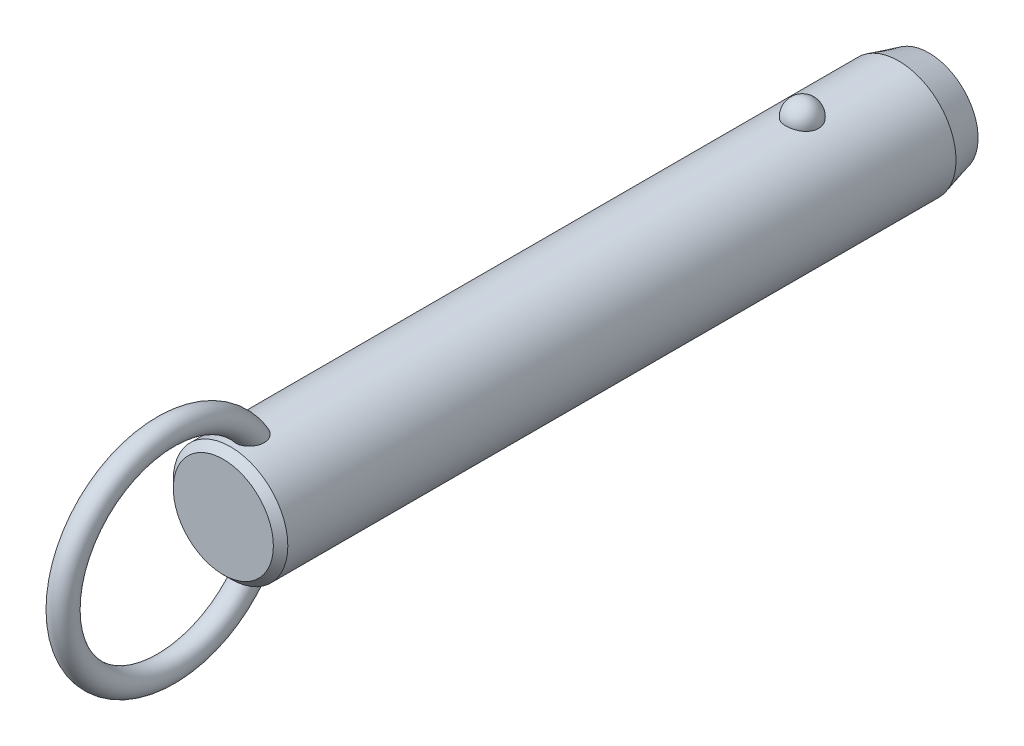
ISO-10303-21;
HEADER;
FILE_DESCRIPTION(('STEP AP214'),'2;1');
FILE_NAME('part.step','',(''),(''),'','','');
FILE_SCHEMA(('AUTOMOTIVE_DESIGN { 1 0 10303 214 1 1 1 1 }'));
ENDSEC;
DATA;
#1=APPLICATION_CONTEXT('core data for automotive mechanical design processes');
#2=APPLICATION_PROTOCOL_DEFINITION('international standard','automotive_design',2000,#1);
#3=PRODUCT_CONTEXT('',#1,'mechanical');
#4=PRODUCT('Part','Part','',(#3));
#5=PRODUCT_RELATED_PRODUCT_CATEGORY('part','',(#4));
#6=PRODUCT_DEFINITION_FORMATION('','',#4);
#7=PRODUCT_DEFINITION_CONTEXT('part definition',#1,'design');
#8=PRODUCT_DEFINITION('design','',#6,#7);
#9=PRODUCT_DEFINITION_SHAPE('','',#8);
#10=(LENGTH_UNIT() NAMED_UNIT(*) SI_UNIT(.MILLI.,.METRE.));
#11=(NAMED_UNIT(*) PLANE_ANGLE_UNIT() SI_UNIT($,.RADIAN.));
#12=(NAMED_UNIT(*) SI_UNIT($,.STERADIAN.) SOLID_ANGLE_UNIT());
#13=UNCERTAINTY_MEASURE_WITH_UNIT(LENGTH_MEASURE(1.E-05),#10,'distance_accuracy_value','');
#14=(GEOMETRIC_REPRESENTATION_CONTEXT(3) GLOBAL_UNCERTAINTY_ASSIGNED_CONTEXT((#13)) GLOBAL_UNIT_ASSIGNED_CONTEXT((#10,
#11,#12)) REPRESENTATION_CONTEXT('',''));
#15=CARTESIAN_POINT('',(0.,0.,0.));
#16=DIRECTION('',(0.,0.,1.));
#17=DIRECTION('',(1.,0.,0.));
#18=AXIS2_PLACEMENT_3D('',#15,#16,#17);
#19=CARTESIAN_POINT('',(0.,0.,83.8));
#20=DIRECTION('',(0.,0.,-1.));
#21=DIRECTION('',(-1.,0.,0.));
#22=AXIS2_PLACEMENT_3D('',#19,#20,#21);
#23=CYLINDRICAL_SURFACE('',#22,9.5);
#24=CARTESIAN_POINT('',(2.67259918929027,9.11631578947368,-2.70000000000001));
#25=CARTESIAN_POINT('',(2.6725968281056,9.11631786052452,-2.54909854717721));
#26=CARTESIAN_POINT('',(2.66030567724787,9.11994722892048,-2.39816735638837));
#27=CARTESIAN_POINT('',(2.6114347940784,9.13405924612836,-2.10058568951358));
#28=CARTESIAN_POINT('',(2.57484658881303,9.14454428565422,-1.95393672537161));
#29=CARTESIAN_POINT('',(2.47830875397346,9.17117631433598,-1.66916069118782));
#30=CARTESIAN_POINT('',(2.41836936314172,9.18732082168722,-1.53102991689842));
#31=CARTESIAN_POINT('',(2.27661331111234,9.22346780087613,-1.26705393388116));
#32=CARTESIAN_POINT('',(2.19479699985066,9.24347021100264,-1.14120852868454));
#33=CARTESIAN_POINT('',(2.01085282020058,9.28522401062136,-0.904632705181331));
#34=CARTESIAN_POINT('',(1.90862396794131,9.30698376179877,-0.793982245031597));
#35=CARTESIAN_POINT('',(1.6867437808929,9.34973971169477,-0.591607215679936));
#36=CARTESIAN_POINT('',(1.56709244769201,9.37073591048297,-0.499882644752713));
#37=CARTESIAN_POINT('',(1.31393976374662,9.40956370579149,-0.338167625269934));
#38=CARTESIAN_POINT('',(1.18048026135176,9.42740444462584,-0.268113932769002));
#39=CARTESIAN_POINT('',(0.903154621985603,9.45799906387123,-0.151390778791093));
#40=CARTESIAN_POINT('',(0.759289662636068,9.47075351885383,-0.104718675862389));
#41=CARTESIAN_POINT('',(0.468074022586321,9.48956256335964,-0.0367633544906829));
#42=CARTESIAN_POINT('',(0.320836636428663,9.49573643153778,-0.0150275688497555));
#43=CARTESIAN_POINT('',(0.0246714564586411,9.50112183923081,0.00396199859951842));
#44=CARTESIAN_POINT('',(-0.124256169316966,9.50033406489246,0.00121819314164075));
#45=CARTESIAN_POINT('',(-0.417264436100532,9.4919475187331,-0.0284441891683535));
#46=CARTESIAN_POINT('',(-0.56138413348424,9.48444885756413,-0.0550074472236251));
#47=CARTESIAN_POINT('',(-0.842986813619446,9.46357853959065,-0.131064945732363));
#48=CARTESIAN_POINT('',(-0.980469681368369,9.450206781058,-0.180559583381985));
#49=CARTESIAN_POINT('',(-1.24585005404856,9.41890822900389,-0.301476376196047));
#50=CARTESIAN_POINT('',(-1.37368611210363,9.40095498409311,-0.373026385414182));
#51=CARTESIAN_POINT('',(-1.61552738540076,9.36242964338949,-0.536025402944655));
#52=CARTESIAN_POINT('',(-1.72953116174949,9.34185727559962,-0.627476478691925));
#53=CARTESIAN_POINT('',(-1.9429225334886,9.29984568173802,-0.829844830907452));
#54=CARTESIAN_POINT('',(-2.04198021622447,9.27839736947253,-0.94110821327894));
#55=CARTESIAN_POINT('',(-2.22026460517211,9.23735994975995,-1.17883414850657));
#56=CARTESIAN_POINT('',(-2.29948985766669,9.21777097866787,-1.30529781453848));
#57=CARTESIAN_POINT('',(-2.43697287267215,9.18238994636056,-1.57158566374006));
#58=CARTESIAN_POINT('',(-2.49497068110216,9.16664569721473,-1.71155057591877));
#59=CARTESIAN_POINT('',(-2.5872073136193,9.14104303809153,-1.99961197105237));
#60=CARTESIAN_POINT('',(-2.62144683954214,9.13118445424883,-2.14770821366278));
#61=CARTESIAN_POINT('',(-2.66521466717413,9.11850622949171,-2.44715424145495));
#62=CARTESIAN_POINT('',(-2.67484831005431,9.11565658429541,-2.59848735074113));
#63=CARTESIAN_POINT('',(-2.66946735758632,9.11723375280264,-2.90067317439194));
#64=CARTESIAN_POINT('',(-2.65445345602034,9.12166036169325,-3.05152590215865));
#65=CARTESIAN_POINT('',(-2.60029711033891,9.13724422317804,-3.34766110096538));
#66=CARTESIAN_POINT('',(-2.56127978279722,9.14836656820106,-3.49296833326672));
#67=CARTESIAN_POINT('',(-2.46018844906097,9.17606676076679,-3.77477535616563));
#68=CARTESIAN_POINT('',(-2.39811349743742,9.1926448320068,-3.9112747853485));
#69=CARTESIAN_POINT('',(-2.25202303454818,9.22952198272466,-4.17244273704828));
#70=CARTESIAN_POINT('',(-2.16788714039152,9.24984129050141,-4.29704106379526));
#71=CARTESIAN_POINT('',(-1.9799408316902,9.29188255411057,-4.53013066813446));
#72=CARTESIAN_POINT('',(-1.87612963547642,9.31360456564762,-4.63862130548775));
#73=CARTESIAN_POINT('',(-1.65105429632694,9.35612959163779,-4.8369029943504));
#74=CARTESIAN_POINT('',(-1.52972405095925,9.37692871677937,-4.92661991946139));
#75=CARTESIAN_POINT('',(-1.27318250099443,9.41518970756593,-5.08429106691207));
#76=CARTESIAN_POINT('',(-1.13797219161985,9.432651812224,-5.15224684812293));
#77=CARTESIAN_POINT('',(-0.859280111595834,9.46208255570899,-5.26371827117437));
#78=CARTESIAN_POINT('',(-0.715925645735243,9.47411833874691,-5.30753421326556));
#79=CARTESIAN_POINT('',(-0.423550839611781,9.4916822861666,-5.37076321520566));
#80=CARTESIAN_POINT('',(-0.2745312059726,9.49721125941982,-5.39017930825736));
#81=CARTESIAN_POINT('',(0.0218446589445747,9.50110860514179,-5.40390587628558));
#82=CARTESIAN_POINT('',(0.16917707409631,9.49961381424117,-5.39869609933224));
#83=CARTESIAN_POINT('',(0.460808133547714,9.48993906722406,-5.36441955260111));
#84=CARTESIAN_POINT('',(0.605106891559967,9.48175936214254,-5.33535367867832));
#85=CARTESIAN_POINT('',(0.886027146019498,9.4596376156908,-5.25435587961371));
#86=CARTESIAN_POINT('',(1.02267710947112,9.44571881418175,-5.20251612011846));
#87=CARTESIAN_POINT('',(1.28523827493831,9.41358993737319,-5.07741549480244));
#88=CARTESIAN_POINT('',(1.41114877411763,9.39537958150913,-5.00415322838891));
#89=CARTESIAN_POINT('',(1.65085227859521,9.3562644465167,-4.83684599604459));
#90=CARTESIAN_POINT('',(1.76442346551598,9.33532178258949,-4.74249218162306));
#91=CARTESIAN_POINT('',(1.97425672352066,9.29321198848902,-4.53620389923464));
#92=CARTESIAN_POINT('',(2.07051582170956,9.27204482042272,-4.42426641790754));
#93=CARTESIAN_POINT('',(2.24490086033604,9.23139221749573,-4.18363183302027));
#94=CARTESIAN_POINT('',(2.32267019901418,9.21194380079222,-4.05466990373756));
#95=CARTESIAN_POINT('',(2.45584092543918,9.1773419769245,-3.78517836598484));
#96=CARTESIAN_POINT('',(2.5112497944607,9.16218713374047,-3.64465264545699));
#97=CARTESIAN_POINT('',(2.59380876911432,9.13913522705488,-3.37104301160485));
#98=CARTESIAN_POINT('',(2.62330266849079,9.13064624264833,-3.23871053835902));
#99=CARTESIAN_POINT('',(2.66269870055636,9.11923566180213,-2.97092664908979));
#100=CARTESIAN_POINT('',(2.67260130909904,9.11631393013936,-2.83547530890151));
#101=CARTESIAN_POINT('',(2.67259918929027,9.11631578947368,-2.70000000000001));
#102=B_SPLINE_CURVE_WITH_KNOTS('',3,(#24,#25,#26,#27,#28,#29,#30,#31,#32,#33,#34,#35,#36,#37,
#38,#39,#40,#41,#42,#43,#44,#45,#46,#47,#48,#49,#50,#51,#52,#53,#54,#55,#56,#57,#58,#59,#60,#61,
#62,#63,#64,#65,#66,#67,#68,#69,#70,#71,#72,#73,#74,#75,#76,#77,#78,#79,#80,#81,#82,#83,#84,#85,
#86,#87,#88,#89,#90,#91,#92,#93,#94,#95,#96,#97,#98,#99,#100,#101),.UNSPECIFIED.,.T.,.F.,(4,2,2,
2,2,2,2,2,2,2,2,2,2,2,2,2,2,2,2,2,2,2,2,2,2,2,2,2,2,2,2,2,2,2,2,2,2,2,4),(0.,0.452217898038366,
0.904593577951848,1.35677112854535,1.80894144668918,2.26340676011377,2.71787203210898,
3.17099820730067,3.62407318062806,4.0687883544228,4.51345969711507,4.95160616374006,
5.38976021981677,5.83050358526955,6.27129275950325,6.72071308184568,7.17016633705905,
7.62495278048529,8.07972578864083,8.53254856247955,8.98535859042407,9.43582813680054,
9.88631615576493,10.3393155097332,10.7923328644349,11.2471065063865,11.7018475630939,
12.150795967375,12.599688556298,13.0398725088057,13.4800399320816,13.9184421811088,
14.3568730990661,14.802202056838,15.2476074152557,15.7010097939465,16.1542603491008,
16.5602594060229,16.966248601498),.UNSPECIFIED.);
#103=CARTESIAN_POINT('',(2.67259918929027,9.11631578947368,-2.70000000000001));
#104=VERTEX_POINT('',#103);
#105=EDGE_CURVE('E41',#104,#104,#102,.T.);
#106=ORIENTED_EDGE('',*,*,#105,.T.);
#107=EDGE_LOOP('',(#106));
#108=FACE_BOUND('',#107,.T.);
#109=CARTESIAN_POINT('',(0.,0.,92.12));
#110=DIRECTION('',(0.,0.,1.));
#111=DIRECTION('',(1.,0.,0.));
#112=AXIS2_PLACEMENT_3D('',#109,#110,#111);
#113=CIRCLE('',#112,9.5);
#114=CARTESIAN_POINT('',(9.5,0.,92.12));
#115=VERTEX_POINT('',#114);
#116=EDGE_CURVE('E10',#115,#115,#113,.F.);
#117=ORIENTED_EDGE('',*,*,#116,.T.);
#118=EDGE_LOOP('',(#117));
#119=FACE_BOUND('',#118,.T.);
#120=CARTESIAN_POINT('',(-0.697062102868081,-9.47439269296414,86.4678088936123));
#121=CARTESIAN_POINT('',(-0.799579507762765,-9.46685146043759,86.5074823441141));
#122=CARTESIAN_POINT('',(-0.898575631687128,-9.45788043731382,86.5559309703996));
#123=CARTESIAN_POINT('',(-1.08670047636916,-9.43811593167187,86.6688685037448));
#124=CARTESIAN_POINT('',(-1.17583204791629,-9.42732297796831,86.7333527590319));
#125=CARTESIAN_POINT('',(-1.34179806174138,-9.40513672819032,86.8762099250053));
#126=CARTESIAN_POINT('',(-1.41865133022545,-9.39374438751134,86.954561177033));
#127=CARTESIAN_POINT('',(-1.5586004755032,-9.37154196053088,87.1227524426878));
#128=CARTESIAN_POINT('',(-1.62169476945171,-9.3607319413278,87.2125937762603));
#129=CARTESIAN_POINT('',(-1.73527695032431,-9.34035749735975,87.4045001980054));
#130=CARTESIAN_POINT('',(-1.7852226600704,-9.33085270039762,87.5068910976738));
#131=CARTESIAN_POINT('',(-1.86924997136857,-9.3143834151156,87.718148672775));
#132=CARTESIAN_POINT('',(-1.90332570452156,-9.30741986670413,87.8270177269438));
#133=CARTESIAN_POINT('',(-1.95893603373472,-9.29588482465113,88.0604730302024));
#134=CARTESIAN_POINT('',(-1.97872420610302,-9.29165182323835,88.1854890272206));
#135=CARTESIAN_POINT('',(-2.00062129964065,-9.28695978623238,88.4370805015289));
#136=CARTESIAN_POINT('',(-2.00272284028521,-9.28650232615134,88.563656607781));
#137=CARTESIAN_POINT('',(-1.98958876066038,-9.28932750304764,88.8368157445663));
#138=CARTESIAN_POINT('',(-1.97143366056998,-9.2932400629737,88.9832519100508));
#139=CARTESIAN_POINT('',(-1.91479925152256,-9.30507151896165,89.2720629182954));
#140=CARTESIAN_POINT('',(-1.87629122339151,-9.31299607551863,89.414431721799));
#141=CARTESIAN_POINT('',(-1.77225683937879,-9.33340232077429,89.7151725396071));
#142=CARTESIAN_POINT('',(-1.70334898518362,-9.34641636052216,89.8723691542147));
#143=CARTESIAN_POINT('',(-1.58111062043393,-9.36759153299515,90.0975171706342));
#144=CARTESIAN_POINT('',(-1.53721459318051,-9.37492619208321,90.1707968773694));
#145=CARTESIAN_POINT('',(-1.44302631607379,-9.38988566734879,90.3130740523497));
#146=CARTESIAN_POINT('',(-1.39273721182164,-9.39751033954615,90.3820736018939));
#147=CARTESIAN_POINT('',(-1.26775962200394,-9.41530678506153,90.5369832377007));
#148=CARTESIAN_POINT('',(-1.19052326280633,-9.42548108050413,90.6208712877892));
#149=CARTESIAN_POINT('',(-1.02420241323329,-9.44499825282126,90.7760086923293));
#150=CARTESIAN_POINT('',(-0.935139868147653,-9.45434261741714,90.8472808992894));
#151=CARTESIAN_POINT('',(-0.766610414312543,-9.46930670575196,90.9586955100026));
#152=CARTESIAN_POINT('',(-0.689439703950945,-9.47529223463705,91.0022354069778));
#153=CARTESIAN_POINT('',(-0.528942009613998,-9.48560294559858,91.0763133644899));
#154=CARTESIAN_POINT('',(-0.445620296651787,-9.48992953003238,91.1068624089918));
#155=CARTESIAN_POINT('',(-0.273901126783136,-9.49644161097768,91.1525792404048));
#156=CARTESIAN_POINT('',(-0.185465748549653,-9.49860811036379,91.16761059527));
#157=CARTESIAN_POINT('',(-0.00734541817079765,-9.5004135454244,91.1801494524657));
#158=CARTESIAN_POINT('',(0.0823387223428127,-9.50005405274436,91.1776678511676));
#159=CARTESIAN_POINT('',(0.247679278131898,-9.49708301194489,91.1569959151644));
#160=CARTESIAN_POINT('',(0.32362017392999,-9.49477609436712,91.1409300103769));
#161=CARTESIAN_POINT('',(0.47198153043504,-9.48855917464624,91.0971726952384));
#162=CARTESIAN_POINT('',(0.544400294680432,-9.48464840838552,91.069475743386));
#163=CARTESIAN_POINT('',(0.708947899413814,-9.47398336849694,90.9928026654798));
#164=CARTESIAN_POINT('',(0.799149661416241,-9.46671310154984,90.9397745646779));
#165=CARTESIAN_POINT('',(0.969783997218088,-9.45076225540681,90.8199731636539));
#166=CARTESIAN_POINT('',(1.05019415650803,-9.44207854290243,90.7531692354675));
#167=CARTESIAN_POINT('',(1.23092343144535,-9.42051459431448,90.5807596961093));
#168=CARTESIAN_POINT('',(1.32652499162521,-9.40733378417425,90.4702619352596));
#169=CARTESIAN_POINT('',(1.49893121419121,-9.38140745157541,90.2355614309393));
#170=CARTESIAN_POINT('',(1.57571616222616,-9.36866239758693,90.1113445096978));
#171=CARTESIAN_POINT('',(1.71285426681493,-9.34457644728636,89.8493891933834));
#172=CARTESIAN_POINT('',(1.77266365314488,-9.33328726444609,89.7113623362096));
#173=CARTESIAN_POINT('',(1.87239208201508,-9.31379209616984,89.4280515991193));
#174=CARTESIAN_POINT('',(1.91230158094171,-9.3055875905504,89.282764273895));
#175=CARTESIAN_POINT('',(1.9760418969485,-9.29228394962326,88.9620281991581));
#176=CARTESIAN_POINT('',(1.99587438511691,-9.28797202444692,88.7857248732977));
#177=CARTESIAN_POINT('',(2.0029570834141,-9.28645519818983,88.4324146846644));
#178=CARTESIAN_POINT('',(1.99025930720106,-9.28923895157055,88.2554093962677));
#179=CARTESIAN_POINT('',(1.93735479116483,-9.30038134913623,87.9563381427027));
#180=CARTESIAN_POINT('',(1.90576827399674,-9.30697680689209,87.8326679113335));
#181=CARTESIAN_POINT('',(1.82287484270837,-9.32356855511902,87.592329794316));
#182=CARTESIAN_POINT('',(1.77158213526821,-9.33356239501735,87.4756569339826));
#183=CARTESIAN_POINT('',(1.6488574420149,-9.35602275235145,87.2527061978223));
#184=CARTESIAN_POINT('',(1.57730995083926,-9.36850332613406,87.1464927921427));
#185=CARTESIAN_POINT('',(1.41543264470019,-9.39431873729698,86.9495530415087));
#186=CARTESIAN_POINT('',(1.32510883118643,-9.40765330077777,86.8588217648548));
#187=CARTESIAN_POINT('',(1.13846223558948,-9.43195720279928,86.7050334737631));
#188=CARTESIAN_POINT('',(1.0436989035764,-9.44302894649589,86.6400947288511));
#189=CARTESIAN_POINT('',(0.843965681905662,-9.46296805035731,86.5280388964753));
#190=CARTESIAN_POINT('',(0.739000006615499,-9.47183631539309,86.4809144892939));
#191=CARTESIAN_POINT('',(0.528175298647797,-9.48586140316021,86.4081173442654));
#192=CARTESIAN_POINT('',(0.422686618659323,-9.49119633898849,86.3814024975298));
#193=CARTESIAN_POINT('',(0.208590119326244,-9.49831365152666,86.3460137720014));
#194=CARTESIAN_POINT('',(0.0999817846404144,-9.500095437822,86.3373428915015));
#195=CARTESIAN_POINT('',(-0.126104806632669,-9.49988861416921,86.3383501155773));
#196=CARTESIAN_POINT('',(-0.243578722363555,-9.49757821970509,86.3495942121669));
#197=CARTESIAN_POINT('',(-0.474390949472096,-9.48885165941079,86.393167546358));
#198=CARTESIAN_POINT('',(-0.587729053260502,-9.48243528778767,86.4254978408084));
#199=CARTESIAN_POINT('',(-0.697062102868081,-9.47439269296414,86.4678088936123));
#200=B_SPLINE_CURVE_WITH_KNOTS('',3,(#120,#121,#122,#123,#124,#125,#126,#127,#128,#129,#130,
#131,#132,#133,#134,#135,#136,#137,#138,#139,#140,#141,#142,#143,#144,#145,#146,#147,#148,#149,
#150,#151,#152,#153,#154,#155,#156,#157,#158,#159,#160,#161,#162,#163,#164,#165,#166,#167,#168,
#169,#170,#171,#172,#173,#174,#175,#176,#177,#178,#179,#180,#181,#182,#183,#184,#185,#186,#187,
#188,#189,#190,#191,#192,#193,#194,#195,#196,#197,#198,#199),.UNSPECIFIED.,.T.,.F.,(4,2,2,2,2,2,
2,2,2,2,2,2,2,2,2,2,2,2,2,2,2,2,2,2,2,2,2,2,2,2,2,2,2,2,2,2,2,2,2,4),(0.,0.330119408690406,
0.660143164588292,0.989655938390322,1.31920659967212,1.66074728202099,2.00241415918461,
2.38088696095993,2.75951768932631,3.20065679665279,3.6424200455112,4.15620996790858,
4.41314162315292,4.66994734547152,5.01228664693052,5.35399933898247,5.61943037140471,
5.88463652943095,6.15215502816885,6.41950709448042,6.65144391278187,6.88349136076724,
7.19641200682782,7.51003602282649,7.9477971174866,8.38601491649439,8.83699707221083,
9.28819530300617,9.81778662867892,10.3465317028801,10.7284172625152,11.110028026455,
11.4938603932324,11.8775702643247,12.2220189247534,12.5663259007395,12.8915939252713,
13.2169159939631,13.5689650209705,13.9210316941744),.UNSPECIFIED.);
#201=CARTESIAN_POINT('',(-0.697062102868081,-9.47439269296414,86.4678088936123));
#202=VERTEX_POINT('',#201);
#203=EDGE_CURVE('E60',#202,#202,#200,.T.);
#204=ORIENTED_EDGE('',*,*,#203,.T.);
#205=EDGE_LOOP('',(#204));
#206=FACE_BOUND('',#205,.T.);
#207=CARTESIAN_POINT('',(-0.697062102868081,9.47439269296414,86.4678088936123));
#208=CARTESIAN_POINT('',(-0.597792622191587,9.48169483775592,86.4293956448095));
#209=CARTESIAN_POINT('',(-0.495106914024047,9.48766580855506,86.3991682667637));
#210=CARTESIAN_POINT('',(-0.285876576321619,9.49627648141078,86.3560327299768));
#211=CARTESIAN_POINT('',(-0.179324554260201,9.49890941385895,86.3431597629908));
#212=CARTESIAN_POINT('',(0.0344157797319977,9.50053798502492,86.3351666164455));
#213=CARTESIAN_POINT('',(0.141603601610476,9.49953613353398,86.3400341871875));
#214=CARTESIAN_POINT('',(0.353563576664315,9.49401038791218,86.3673654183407));
#215=CARTESIAN_POINT('',(0.45833679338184,9.48948807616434,86.38982117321));
#216=CARTESIAN_POINT('',(0.662493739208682,9.4774236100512,86.4516719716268));
#217=CARTESIAN_POINT('',(0.761881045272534,9.46988348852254,86.4910556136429));
#218=CARTESIAN_POINT('',(0.952608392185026,9.45260382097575,86.5856342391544));
#219=CARTESIAN_POINT('',(1.04394806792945,9.44286417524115,86.6408299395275));
#220=CARTESIAN_POINT('',(1.21712767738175,9.4221176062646,86.7660662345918));
#221=CARTESIAN_POINT('',(1.29885671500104,9.41109835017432,86.8362579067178));
#222=CARTESIAN_POINT('',(1.44978975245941,9.38903310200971,86.988980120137));
#223=CARTESIAN_POINT('',(1.51899278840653,9.37798710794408,87.0715116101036));
#224=CARTESIAN_POINT('',(1.64602857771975,9.35654375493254,87.2497763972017));
#225=CARTESIAN_POINT('',(1.70333052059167,9.34618688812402,87.3458916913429));
#226=CARTESIAN_POINT('',(1.80259341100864,9.32755128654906,87.545897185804));
#227=CARTESIAN_POINT('',(1.84454942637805,9.31927322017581,87.6497898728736));
#228=CARTESIAN_POINT('',(1.91637039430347,9.30478365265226,87.8722131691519));
#229=CARTESIAN_POINT('',(1.944805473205,9.29882552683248,87.9912192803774));
#230=CARTESIAN_POINT('',(1.98449865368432,9.29043398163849,88.2321436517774));
#231=CARTESIAN_POINT('',(1.99574908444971,9.28800213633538,88.3540631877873));
#232=CARTESIAN_POINT('',(2.00275141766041,9.28649645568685,88.6169324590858));
#233=CARTESIAN_POINT('',(1.99588238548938,9.28799035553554,88.7579529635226));
#234=CARTESIAN_POINT('',(1.96270559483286,9.29505517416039,89.0376217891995));
#235=CARTESIAN_POINT('',(1.93637872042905,9.30063010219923,89.176267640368));
#236=CARTESIAN_POINT('',(1.85949176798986,9.31633564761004,89.4725616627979));
#237=CARTESIAN_POINT('',(1.80549792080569,9.3270926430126,89.6292907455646));
#238=CARTESIAN_POINT('',(1.67376869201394,9.35163064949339,89.9322840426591));
#239=CARTESIAN_POINT('',(1.59603181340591,9.36541185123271,90.0785475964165));
#240=CARTESIAN_POINT('',(1.43602774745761,9.39110706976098,90.3258138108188));
#241=CARTESIAN_POINT('',(1.35831795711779,9.40278656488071,90.429791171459));
#242=CARTESIAN_POINT('',(1.18774483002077,9.42585025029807,90.6245347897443));
#243=CARTESIAN_POINT('',(1.09490932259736,9.43723493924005,90.7153247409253));
#244=CARTESIAN_POINT('',(0.921110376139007,9.45552616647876,90.8562033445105));
#245=CARTESIAN_POINT('',(0.843738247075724,9.46281058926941,90.9106563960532));
#246=CARTESIAN_POINT('',(0.681245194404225,9.47589120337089,91.0067117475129));
#247=CARTESIAN_POINT('',(0.596135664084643,9.48168953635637,91.0483325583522));
#248=CARTESIAN_POINT('',(0.433779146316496,9.49038144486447,91.1100899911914));
#249=CARTESIAN_POINT('',(0.357459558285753,9.49359170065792,91.1326013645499));
#250=CARTESIAN_POINT('',(0.202074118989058,9.49816761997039,91.1645745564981));
#251=CARTESIAN_POINT('',(0.123010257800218,9.49953459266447,91.1740456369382));
#252=CARTESIAN_POINT('',(-0.0357372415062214,9.50026497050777,91.1791143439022));
#253=CARTESIAN_POINT('',(-0.115421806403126,9.49962433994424,91.1746840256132));
#254=CARTESIAN_POINT('',(-0.272823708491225,9.49640854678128,91.1522962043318));
#255=CARTESIAN_POINT('',(-0.350540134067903,9.4938325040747,91.1343325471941));
#256=CARTESIAN_POINT('',(-0.500580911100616,9.4870946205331,91.0868028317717));
#257=CARTESIAN_POINT('',(-0.572979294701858,9.48296359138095,91.0574618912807));
#258=CARTESIAN_POINT('',(-0.712864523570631,9.47347609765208,90.9890087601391));
#259=CARTESIAN_POINT('',(-0.780349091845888,9.46811906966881,90.9498920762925));
#260=CARTESIAN_POINT('',(-0.94630921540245,9.45329720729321,90.8394327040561));
#261=CARTESIAN_POINT('',(-1.04090230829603,9.44321512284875,90.7623297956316));
#262=CARTESIAN_POINT('',(-1.21661929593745,9.42219227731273,90.5940971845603));
#263=CARTESIAN_POINT('',(-1.2977051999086,9.41124921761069,90.5029292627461));
#264=CARTESIAN_POINT('',(-1.47319646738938,9.38563439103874,90.2761621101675));
#265=CARTESIAN_POINT('',(-1.56208878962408,9.37102009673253,90.1362895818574));
#266=CARTESIAN_POINT('',(-1.71623987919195,9.34401559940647,89.8439503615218));
#267=CARTESIAN_POINT('',(-1.78147866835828,9.33162728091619,89.691473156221));
#268=CARTESIAN_POINT('',(-1.88853837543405,9.31055541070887,89.3756470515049));
#269=CARTESIAN_POINT('',(-1.92998995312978,9.30193076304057,89.2121685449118));
#270=CARTESIAN_POINT('',(-1.98590726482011,9.29015757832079,88.8805268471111));
#271=CARTESIAN_POINT('',(-2.0004070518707,9.2870021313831,88.7123698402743));
#272=CARTESIAN_POINT('',(-1.99964701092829,9.28716218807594,88.4050806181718));
#273=CARTESIAN_POINT('',(-1.9890814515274,9.28945704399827,88.2659362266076));
#274=CARTESIAN_POINT('',(-1.94566294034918,9.29865169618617,87.9911539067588));
#275=CARTESIAN_POINT('',(-1.9128206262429,9.30554929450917,87.855514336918));
#276=CARTESIAN_POINT('',(-1.84582133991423,9.31898248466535,87.6578026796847));
#277=CARTESIAN_POINT('',(-1.82038084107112,9.32400364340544,87.592583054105));
#278=CARTESIAN_POINT('',(-1.76350511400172,9.33492884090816,87.4649033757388));
#279=CARTESIAN_POINT('',(-1.73207305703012,9.34083241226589,87.4024418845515));
#280=CARTESIAN_POINT('',(-1.66324243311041,9.35333332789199,87.2809407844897));
#281=CARTESIAN_POINT('',(-1.625842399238,9.35993084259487,87.221902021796));
#282=CARTESIAN_POINT('',(-1.54527678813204,9.37356864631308,87.1079875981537));
#283=CARTESIAN_POINT('',(-1.50211241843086,9.38060884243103,87.0531110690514));
#284=CARTESIAN_POINT('',(-1.3768114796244,9.40004442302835,86.909961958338));
#285=CARTESIAN_POINT('',(-1.28916358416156,9.41261047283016,86.8264295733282));
#286=CARTESIAN_POINT('',(-1.09996826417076,9.43658180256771,86.6772360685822));
#287=CARTESIAN_POINT('',(-0.998461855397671,9.44799034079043,86.6115238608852));
#288=CARTESIAN_POINT('',(-0.860188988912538,9.46103017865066,86.5394367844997));
#289=CARTESIAN_POINT('',(-0.828141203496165,9.46389141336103,86.5238511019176));
#290=CARTESIAN_POINT('',(-0.763210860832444,9.46934915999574,86.4944734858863));
#291=CARTESIAN_POINT('',(-0.73032830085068,9.47194567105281,86.4806815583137));
#292=CARTESIAN_POINT('',(-0.697062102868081,9.47439269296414,86.4678088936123));
#293=B_SPLINE_CURVE_WITH_KNOTS('',3,(#207,#208,#209,#210,#211,#212,#213,#214,#215,#216,#217,
#218,#219,#220,#221,#222,#223,#224,#225,#226,#227,#228,#229,#230,#231,#232,#233,#234,#235,#236,
#237,#238,#239,#240,#241,#242,#243,#244,#245,#246,#247,#248,#249,#250,#251,#252,#253,#254,#255,
#256,#257,#258,#259,#260,#261,#262,#263,#264,#265,#266,#267,#268,#269,#270,#271,#272,#273,#274,
#275,#276,#277,#278,#279,#280,#281,#282,#283,#284,#285,#286,#287,#288,#289,#290,#291,#292),
.UNSPECIFIED.,.T.,.F.,(4,2,2,2,2,2,2,2,2,2,2,2,2,2,2,2,2,2,2,2,2,2,2,2,2,2,2,2,2,2,2,2,2,2,2,2,
2,2,2,2,2,2,4),(0.,0.319942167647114,0.640532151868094,0.960900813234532,1.28112555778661,
1.60113495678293,1.92115886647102,2.24457323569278,2.56801248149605,2.90371927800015,
3.23953387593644,3.60560313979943,3.97183576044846,4.393836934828,4.81625324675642,
5.31257045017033,5.80891895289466,6.19868344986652,6.58773876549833,6.87145417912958,
7.15475838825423,7.3926375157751,7.63034760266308,7.86853584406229,8.10683246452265,
8.3406366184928,8.57454843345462,8.93983939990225,9.30614105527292,9.80266668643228,
10.2996107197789,10.8040753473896,11.3079021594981,11.7249776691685,12.1418541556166,
12.3521485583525,12.5623319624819,12.7725671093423,12.9827582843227,13.345827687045,
13.7078449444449,13.8150604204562,13.9222762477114),.UNSPECIFIED.);
#294=CARTESIAN_POINT('',(-0.697062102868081,9.47439269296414,86.4678088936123));
#295=VERTEX_POINT('',#294);
#296=EDGE_CURVE('E68',#295,#295,#293,.T.);
#297=ORIENTED_EDGE('',*,*,#296,.T.);
#298=EDGE_LOOP('',(#297));
#299=FACE_BOUND('',#298,.T.);
#300=CARTESIAN_POINT('',(0.,0.,-18.6999999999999));
#301=DIRECTION('',(0.,0.,-1.));
#302=DIRECTION('',(-1.,0.,0.));
#303=AXIS2_PLACEMENT_3D('',#300,#301,#302);
#304=CIRCLE('',#303,9.5);
#305=CARTESIAN_POINT('',(-9.5,0.,-18.6999999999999));
#306=VERTEX_POINT('',#305);
#307=EDGE_CURVE('E57',#306,#306,#304,.F.);
#308=ORIENTED_EDGE('',*,*,#307,.T.);
#309=EDGE_LOOP('',(#308));
#310=FACE_BOUND('',#309,.T.);
#311=ADVANCED_FACE('F37',(#108,#119,#206,#299,#310),#23,.T.);
#312=CARTESIAN_POINT('',(0.,0.,-23.7));
#313=DIRECTION('',(0.,0.,-1.));
#314=DIRECTION('',(-1.,0.,0.));
#315=AXIS2_PLACEMENT_3D('',#312,#313,#314);
#316=PLANE('',#315);
#317=CARTESIAN_POINT('',(0.,0.,-23.7));
#318=DIRECTION('',(0.,0.,-1.));
#319=DIRECTION('',(-1.,0.,0.));
#320=AXIS2_PLACEMENT_3D('',#317,#318,#319);
#321=CIRCLE('',#320,8.16025403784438);
#322=CARTESIAN_POINT('',(-8.16025403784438,0.,-23.7));
#323=VERTEX_POINT('',#322);
#324=EDGE_CURVE('E67',#323,#323,#321,.T.);
#325=ORIENTED_EDGE('',*,*,#324,.T.);
#326=EDGE_LOOP('',(#325));
#327=FACE_BOUND('',#326,.T.);
#328=ADVANCED_FACE('F86',(#327),#316,.T.);
#329=CARTESIAN_POINT('',(0.,0.,-23.7));
#330=DIRECTION('',(0.,0.,1.));
#331=DIRECTION('',(1.,0.,0.));
#332=AXIS2_PLACEMENT_3D('',#329,#330,#331);
#333=CONICAL_SURFACE('',#332,8.16025403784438,0.261799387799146);
#334=ORIENTED_EDGE('',*,*,#307,.F.);
#335=EDGE_LOOP('',(#334));
#336=FACE_BOUND('',#335,.T.);
#337=ORIENTED_EDGE('',*,*,#324,.F.);
#338=EDGE_LOOP('',(#337));
#339=FACE_BOUND('',#338,.T.);
#340=ADVANCED_FACE('F84',(#336,#339),#333,.T.);
#341=CARTESIAN_POINT('',(0.,0.,93.32));
#342=DIRECTION('',(0.,0.,1.));
#343=DIRECTION('',(1.,0.,0.));
#344=AXIS2_PLACEMENT_3D('',#341,#342,#343);
#345=PLANE('',#344);
#346=CARTESIAN_POINT('',(0.,0.,93.32));
#347=DIRECTION('',(0.,0.,1.));
#348=DIRECTION('',(1.,0.,0.));
#349=AXIS2_PLACEMENT_3D('',#346,#347,#348);
#350=CIRCLE('',#349,8.30000000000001);
#351=CARTESIAN_POINT('',(8.30000000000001,0.,93.32));
#352=VERTEX_POINT('',#351);
#353=EDGE_CURVE('E50',#352,#352,#350,.T.);
#354=ORIENTED_EDGE('',*,*,#353,.T.);
#355=EDGE_LOOP('',(#354));
#356=FACE_BOUND('',#355,.T.);
#357=ADVANCED_FACE('F78',(#356),#345,.T.);
#358=CARTESIAN_POINT('',(0.,0.,102.85));
#359=DIRECTION('',(1.,0.,0.));
#360=DIRECTION('',(0.,0.,-1.));
#361=AXIS2_PLACEMENT_3D('',#358,#359,#360);
#362=TOROIDAL_SURFACE('',#361,17.05,2.);
#363=ORIENTED_EDGE('',*,*,#296,.F.);
#364=EDGE_LOOP('',(#363));
#365=FACE_BOUND('',#364,.T.);
#366=ORIENTED_EDGE('',*,*,#203,.F.);
#367=EDGE_LOOP('',(#366));
#368=FACE_BOUND('',#367,.T.);
#369=ADVANCED_FACE('F74',(#365,#368),#362,.T.);
#370=CARTESIAN_POINT('',(0.,0.,93.32));
#371=DIRECTION('',(0.,0.,-1.));
#372=DIRECTION('',(-1.,0.,0.));
#373=AXIS2_PLACEMENT_3D('',#370,#371,#372);
#374=CONICAL_SURFACE('',#373,8.30000000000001,0.785398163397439);
#375=ORIENTED_EDGE('',*,*,#116,.F.);
#376=EDGE_LOOP('',(#375));
#377=FACE_BOUND('',#376,.T.);
#378=ORIENTED_EDGE('',*,*,#353,.F.);
#379=EDGE_LOOP('',(#378));
#380=FACE_BOUND('',#379,.T.);
#381=ADVANCED_FACE('F39',(#377,#380),#374,.T.);
#382=CARTESIAN_POINT('',(0.,9.5,-2.70000000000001));
#383=DIRECTION('',(0.,1.,0.));
#384=DIRECTION('',(0.,0.,-1.));
#385=AXIS2_PLACEMENT_3D('',#382,#383,#384);
#386=SPHERICAL_SURFACE('',#385,2.7);
#387=ORIENTED_EDGE('',*,*,#105,.F.);
#388=EDGE_LOOP('',(#387));
#389=FACE_BOUND('',#388,.T.);
#390=ADVANCED_FACE('F80',(#389),#386,.T.);
#391=CLOSED_SHELL('',(#311,#328,#340,#357,#369,#381,#390));
#392=MANIFOLD_SOLID_BREP('B2',#391);
#393=ADVANCED_BREP_SHAPE_REPRESENTATION('',(#18,#392),#14);
#394=SHAPE_DEFINITION_REPRESENTATION(#9,#393);
ENDSEC;
END-ISO-10303-21;
